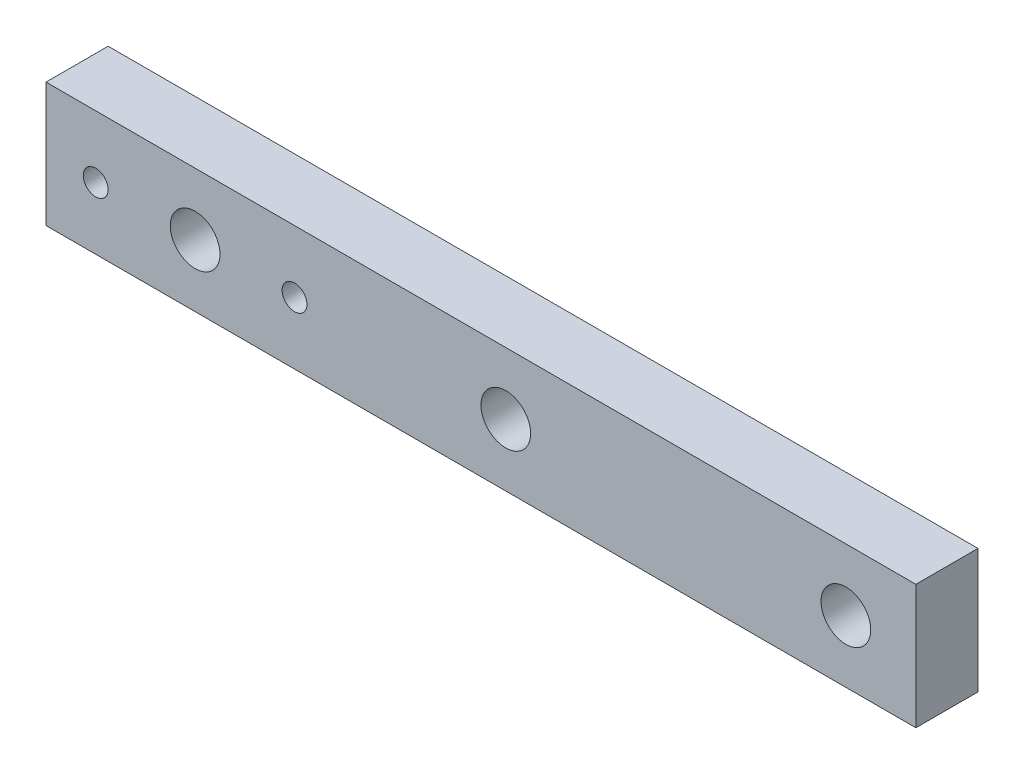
ISO-10303-21;
HEADER;
FILE_DESCRIPTION(('STEP AP214'),'2;1');
FILE_NAME('part.step','',(''),(''),'','','');
FILE_SCHEMA(('AUTOMOTIVE_DESIGN { 1 0 10303 214 1 1 1 1 }'));
ENDSEC;
DATA;
#1=APPLICATION_CONTEXT('core data for automotive mechanical design processes');
#2=APPLICATION_PROTOCOL_DEFINITION('international standard','automotive_design',2000,#1);
#3=PRODUCT_CONTEXT('',#1,'mechanical');
#4=PRODUCT('Part','Part','',(#3));
#5=PRODUCT_RELATED_PRODUCT_CATEGORY('part','',(#4));
#6=PRODUCT_DEFINITION_FORMATION('','',#4);
#7=PRODUCT_DEFINITION_CONTEXT('part definition',#1,'design');
#8=PRODUCT_DEFINITION('design','',#6,#7);
#9=PRODUCT_DEFINITION_SHAPE('','',#8);
#10=(LENGTH_UNIT() NAMED_UNIT(*) SI_UNIT(.MILLI.,.METRE.));
#11=(NAMED_UNIT(*) PLANE_ANGLE_UNIT() SI_UNIT($,.RADIAN.));
#12=(NAMED_UNIT(*) SI_UNIT($,.STERADIAN.) SOLID_ANGLE_UNIT());
#13=UNCERTAINTY_MEASURE_WITH_UNIT(LENGTH_MEASURE(1.E-05),#10,'distance_accuracy_value','');
#14=(GEOMETRIC_REPRESENTATION_CONTEXT(3) GLOBAL_UNCERTAINTY_ASSIGNED_CONTEXT((#13)) GLOBAL_UNIT_ASSIGNED_CONTEXT((#10,
#11,#12)) REPRESENTATION_CONTEXT('',''));
#15=CARTESIAN_POINT('',(0.,0.,0.));
#16=DIRECTION('',(0.,0.,1.));
#17=DIRECTION('',(1.,0.,0.));
#18=AXIS2_PLACEMENT_3D('',#15,#16,#17);
#19=CARTESIAN_POINT('',(-33.,5.,5.));
#20=DIRECTION('',(1.,0.,0.));
#21=DIRECTION('',(0.,0.,-1.));
#22=AXIS2_PLACEMENT_3D('',#19,#20,#21);
#23=PLANE('',#22);
#24=DIRECTION('',(0.,-1.,0.));
#25=VECTOR('',#24,1.);
#26=CARTESIAN_POINT('',(-33.,5.,0.));
#27=LINE('',#26,#25);
#28=CARTESIAN_POINT('',(-33.,5.,0.));
#29=VERTEX_POINT('',#28);
#30=CARTESIAN_POINT('',(-33.,-5.,0.));
#31=VERTEX_POINT('',#30);
#32=EDGE_CURVE('E98',#29,#31,#27,.T.);
#33=ORIENTED_EDGE('',*,*,#32,.T.);
#34=DIRECTION('',(0.,0.,-1.));
#35=VECTOR('',#34,1.);
#36=CARTESIAN_POINT('',(-33.,-5.,5.));
#37=LINE('',#36,#35);
#38=CARTESIAN_POINT('',(-33.,-5.,5.));
#39=VERTEX_POINT('',#38);
#40=EDGE_CURVE('E11',#39,#31,#37,.T.);
#41=ORIENTED_EDGE('',*,*,#40,.F.);
#42=DIRECTION('',(0.,-1.,0.));
#43=VECTOR('',#42,1.);
#44=CARTESIAN_POINT('',(-33.,5.,5.));
#45=LINE('',#44,#43);
#46=CARTESIAN_POINT('',(-33.,5.,5.));
#47=VERTEX_POINT('',#46);
#48=EDGE_CURVE('E86',#47,#39,#45,.T.);
#49=ORIENTED_EDGE('',*,*,#48,.F.);
#50=DIRECTION('',(0.,0.,-1.));
#51=VECTOR('',#50,1.);
#52=CARTESIAN_POINT('',(-33.,5.,5.));
#53=LINE('',#52,#51);
#54=EDGE_CURVE('E94',#47,#29,#53,.T.);
#55=ORIENTED_EDGE('',*,*,#54,.T.);
#56=EDGE_LOOP('',(#33,#41,#49,#55));
#57=FACE_BOUND('',#56,.T.);
#58=ADVANCED_FACE('F35',(#57),#23,.F.);
#59=CARTESIAN_POINT('',(-33.,-5.,5.));
#60=DIRECTION('',(0.,1.,0.));
#61=DIRECTION('',(0.,0.,1.));
#62=AXIS2_PLACEMENT_3D('',#59,#60,#61);
#63=PLANE('',#62);
#64=DIRECTION('',(1.,0.,0.));
#65=VECTOR('',#64,1.);
#66=CARTESIAN_POINT('',(-33.,-5.,0.));
#67=LINE('',#66,#65);
#68=CARTESIAN_POINT('',(37.,-5.,0.));
#69=VERTEX_POINT('',#68);
#70=EDGE_CURVE('E90',#31,#69,#67,.T.);
#71=ORIENTED_EDGE('',*,*,#70,.T.);
#72=DIRECTION('',(0.,0.,-1.));
#73=VECTOR('',#72,1.);
#74=CARTESIAN_POINT('',(37.,-5.,5.));
#75=LINE('',#74,#73);
#76=CARTESIAN_POINT('',(37.,-5.,5.));
#77=VERTEX_POINT('',#76);
#78=EDGE_CURVE('E43',#77,#69,#75,.T.);
#79=ORIENTED_EDGE('',*,*,#78,.F.);
#80=DIRECTION('',(1.,0.,0.));
#81=VECTOR('',#80,1.);
#82=CARTESIAN_POINT('',(-33.,-5.,5.));
#83=LINE('',#82,#81);
#84=EDGE_CURVE('E81',#39,#77,#83,.T.);
#85=ORIENTED_EDGE('',*,*,#84,.F.);
#86=ORIENTED_EDGE('',*,*,#40,.T.);
#87=EDGE_LOOP('',(#71,#79,#85,#86));
#88=FACE_BOUND('',#87,.T.);
#89=ADVANCED_FACE('F89',(#88),#63,.F.);
#90=CARTESIAN_POINT('',(37.,5.,5.));
#91=DIRECTION('',(-1.,0.,0.));
#92=DIRECTION('',(0.,-1.,0.));
#93=AXIS2_PLACEMENT_3D('',#90,#91,#92);
#94=PLANE('',#93);
#95=DIRECTION('',(0.,1.,0.));
#96=VECTOR('',#95,1.);
#97=CARTESIAN_POINT('',(37.,5.,0.));
#98=LINE('',#97,#96);
#99=CARTESIAN_POINT('',(37.,5.,0.));
#100=VERTEX_POINT('',#99);
#101=EDGE_CURVE('E68',#69,#100,#98,.T.);
#102=ORIENTED_EDGE('',*,*,#101,.T.);
#103=DIRECTION('',(0.,0.,-1.));
#104=VECTOR('',#103,1.);
#105=CARTESIAN_POINT('',(37.,5.,5.));
#106=LINE('',#105,#104);
#107=CARTESIAN_POINT('',(37.,5.,5.));
#108=VERTEX_POINT('',#107);
#109=EDGE_CURVE('E91',#108,#100,#106,.T.);
#110=ORIENTED_EDGE('',*,*,#109,.F.);
#111=DIRECTION('',(0.,1.,0.));
#112=VECTOR('',#111,1.);
#113=CARTESIAN_POINT('',(37.,5.,5.));
#114=LINE('',#113,#112);
#115=EDGE_CURVE('E84',#77,#108,#114,.T.);
#116=ORIENTED_EDGE('',*,*,#115,.F.);
#117=ORIENTED_EDGE('',*,*,#78,.T.);
#118=EDGE_LOOP('',(#102,#110,#116,#117));
#119=FACE_BOUND('',#118,.T.);
#120=ADVANCED_FACE('F92',(#119),#94,.F.);
#121=CARTESIAN_POINT('',(-33.,5.,5.));
#122=DIRECTION('',(0.,-1.,0.));
#123=DIRECTION('',(0.,0.,-1.));
#124=AXIS2_PLACEMENT_3D('',#121,#122,#123);
#125=PLANE('',#124);
#126=DIRECTION('',(-1.,0.,0.));
#127=VECTOR('',#126,1.);
#128=CARTESIAN_POINT('',(-33.,5.,0.));
#129=LINE('',#128,#127);
#130=EDGE_CURVE('E74',#100,#29,#129,.T.);
#131=ORIENTED_EDGE('',*,*,#130,.T.);
#132=ORIENTED_EDGE('',*,*,#54,.F.);
#133=DIRECTION('',(-1.,0.,0.));
#134=VECTOR('',#133,1.);
#135=CARTESIAN_POINT('',(-33.,5.,5.));
#136=LINE('',#135,#134);
#137=EDGE_CURVE('E51',#108,#47,#136,.T.);
#138=ORIENTED_EDGE('',*,*,#137,.F.);
#139=ORIENTED_EDGE('',*,*,#109,.T.);
#140=EDGE_LOOP('',(#131,#132,#138,#139));
#141=FACE_BOUND('',#140,.T.);
#142=ADVANCED_FACE('F106',(#141),#125,.F.);
#143=CARTESIAN_POINT('',(0.,0.,5.));
#144=DIRECTION('',(0.,0.,1.));
#145=DIRECTION('',(1.,0.,0.));
#146=AXIS2_PLACEMENT_3D('',#143,#144,#145);
#147=PLANE('',#146);
#148=CARTESIAN_POINT('',(31.367,0.,5.));
#149=DIRECTION('',(0.,0.,1.));
#150=DIRECTION('',(1.,0.,0.));
#151=AXIS2_PLACEMENT_3D('',#148,#149,#150);
#152=CIRCLE('',#151,2.00000000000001);
#153=CARTESIAN_POINT('',(33.367,0.,5.));
#154=VERTEX_POINT('',#153);
#155=EDGE_CURVE('E136',#154,#154,#152,.T.);
#156=ORIENTED_EDGE('',*,*,#155,.F.);
#157=EDGE_LOOP('',(#156));
#158=FACE_BOUND('',#157,.T.);
#159=CARTESIAN_POINT('',(4.,0.,5.));
#160=DIRECTION('',(0.,0.,1.));
#161=DIRECTION('',(1.,0.,0.));
#162=AXIS2_PLACEMENT_3D('',#159,#160,#161);
#163=CIRCLE('',#162,2.);
#164=CARTESIAN_POINT('',(6.,0.,5.));
#165=VERTEX_POINT('',#164);
#166=EDGE_CURVE('E130',#165,#165,#163,.T.);
#167=ORIENTED_EDGE('',*,*,#166,.F.);
#168=EDGE_LOOP('',(#167));
#169=FACE_BOUND('',#168,.T.);
#170=CARTESIAN_POINT('',(-13.,0.,5.));
#171=DIRECTION('',(0.,0.,1.));
#172=DIRECTION('',(1.,0.,0.));
#173=AXIS2_PLACEMENT_3D('',#170,#171,#172);
#174=CIRCLE('',#173,1.);
#175=CARTESIAN_POINT('',(-12.,0.,5.));
#176=VERTEX_POINT('',#175);
#177=EDGE_CURVE('E124',#176,#176,#174,.T.);
#178=ORIENTED_EDGE('',*,*,#177,.F.);
#179=EDGE_LOOP('',(#178));
#180=FACE_BOUND('',#179,.T.);
#181=CARTESIAN_POINT('',(-21.,0.,5.));
#182=DIRECTION('',(0.,0.,1.));
#183=DIRECTION('',(1.,0.,0.));
#184=AXIS2_PLACEMENT_3D('',#181,#182,#183);
#185=CIRCLE('',#184,2.);
#186=CARTESIAN_POINT('',(-19.,0.,5.));
#187=VERTEX_POINT('',#186);
#188=EDGE_CURVE('E118',#187,#187,#185,.T.);
#189=ORIENTED_EDGE('',*,*,#188,.F.);
#190=EDGE_LOOP('',(#189));
#191=FACE_BOUND('',#190,.T.);
#192=CARTESIAN_POINT('',(-29.,0.,5.));
#193=DIRECTION('',(0.,0.,1.));
#194=DIRECTION('',(1.,0.,0.));
#195=AXIS2_PLACEMENT_3D('',#192,#193,#194);
#196=CIRCLE('',#195,1.);
#197=CARTESIAN_POINT('',(-28.,0.,5.));
#198=VERTEX_POINT('',#197);
#199=EDGE_CURVE('E112',#198,#198,#196,.T.);
#200=ORIENTED_EDGE('',*,*,#199,.F.);
#201=EDGE_LOOP('',(#200));
#202=FACE_BOUND('',#201,.T.);
#203=ORIENTED_EDGE('',*,*,#48,.T.);
#204=ORIENTED_EDGE('',*,*,#84,.T.);
#205=ORIENTED_EDGE('',*,*,#115,.T.);
#206=ORIENTED_EDGE('',*,*,#137,.T.);
#207=EDGE_LOOP('',(#203,#204,#205,#206));
#208=FACE_BOUND('',#207,.T.);
#209=ADVANCED_FACE('F82',(#158,#169,#180,#191,#202,#208),#147,.T.);
#210=CARTESIAN_POINT('',(0.,0.,0.));
#211=DIRECTION('',(0.,0.,1.));
#212=DIRECTION('',(1.,0.,0.));
#213=AXIS2_PLACEMENT_3D('',#210,#211,#212);
#214=PLANE('',#213);
#215=CARTESIAN_POINT('',(31.367,0.,0.));
#216=DIRECTION('',(0.,0.,1.));
#217=DIRECTION('',(1.,0.,0.));
#218=AXIS2_PLACEMENT_3D('',#215,#216,#217);
#219=CIRCLE('',#218,2.00000000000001);
#220=CARTESIAN_POINT('',(33.367,0.,0.));
#221=VERTEX_POINT('',#220);
#222=EDGE_CURVE('E133',#221,#221,#219,.T.);
#223=ORIENTED_EDGE('',*,*,#222,.T.);
#224=EDGE_LOOP('',(#223));
#225=FACE_BOUND('',#224,.T.);
#226=CARTESIAN_POINT('',(4.,0.,0.));
#227=DIRECTION('',(0.,0.,1.));
#228=DIRECTION('',(1.,0.,0.));
#229=AXIS2_PLACEMENT_3D('',#226,#227,#228);
#230=CIRCLE('',#229,2.);
#231=CARTESIAN_POINT('',(6.,0.,0.));
#232=VERTEX_POINT('',#231);
#233=EDGE_CURVE('E127',#232,#232,#230,.T.);
#234=ORIENTED_EDGE('',*,*,#233,.T.);
#235=EDGE_LOOP('',(#234));
#236=FACE_BOUND('',#235,.T.);
#237=CARTESIAN_POINT('',(-13.,0.,0.));
#238=DIRECTION('',(0.,0.,1.));
#239=DIRECTION('',(1.,0.,0.));
#240=AXIS2_PLACEMENT_3D('',#237,#238,#239);
#241=CIRCLE('',#240,1.);
#242=CARTESIAN_POINT('',(-12.,0.,0.));
#243=VERTEX_POINT('',#242);
#244=EDGE_CURVE('E121',#243,#243,#241,.T.);
#245=ORIENTED_EDGE('',*,*,#244,.T.);
#246=EDGE_LOOP('',(#245));
#247=FACE_BOUND('',#246,.T.);
#248=CARTESIAN_POINT('',(-21.,0.,0.));
#249=DIRECTION('',(0.,0.,1.));
#250=DIRECTION('',(1.,0.,0.));
#251=AXIS2_PLACEMENT_3D('',#248,#249,#250);
#252=CIRCLE('',#251,2.);
#253=CARTESIAN_POINT('',(-19.,0.,0.));
#254=VERTEX_POINT('',#253);
#255=EDGE_CURVE('E115',#254,#254,#252,.T.);
#256=ORIENTED_EDGE('',*,*,#255,.T.);
#257=EDGE_LOOP('',(#256));
#258=FACE_BOUND('',#257,.T.);
#259=CARTESIAN_POINT('',(-29.,0.,0.));
#260=DIRECTION('',(0.,0.,1.));
#261=DIRECTION('',(1.,0.,0.));
#262=AXIS2_PLACEMENT_3D('',#259,#260,#261);
#263=CIRCLE('',#262,1.);
#264=CARTESIAN_POINT('',(-28.,0.,0.));
#265=VERTEX_POINT('',#264);
#266=EDGE_CURVE('E101',#265,#265,#263,.T.);
#267=ORIENTED_EDGE('',*,*,#266,.T.);
#268=EDGE_LOOP('',(#267));
#269=FACE_BOUND('',#268,.T.);
#270=ORIENTED_EDGE('',*,*,#32,.F.);
#271=ORIENTED_EDGE('',*,*,#130,.F.);
#272=ORIENTED_EDGE('',*,*,#101,.F.);
#273=ORIENTED_EDGE('',*,*,#70,.F.);
#274=EDGE_LOOP('',(#270,#271,#272,#273));
#275=FACE_BOUND('',#274,.T.);
#276=ADVANCED_FACE('F109',(#225,#236,#247,#258,#269,#275),#214,.F.);
#277=CARTESIAN_POINT('',(-29.,0.,0.));
#278=DIRECTION('',(0.,0.,1.));
#279=DIRECTION('',(1.,0.,0.));
#280=AXIS2_PLACEMENT_3D('',#277,#278,#279);
#281=CYLINDRICAL_SURFACE('',#280,1.);
#282=ORIENTED_EDGE('',*,*,#266,.F.);
#283=EDGE_LOOP('',(#282));
#284=FACE_BOUND('',#283,.T.);
#285=ORIENTED_EDGE('',*,*,#199,.T.);
#286=EDGE_LOOP('',(#285));
#287=FACE_BOUND('',#286,.T.);
#288=ADVANCED_FACE('F162',(#284,#287),#281,.F.);
#289=CARTESIAN_POINT('',(-21.,0.,0.));
#290=DIRECTION('',(0.,0.,1.));
#291=DIRECTION('',(1.,0.,0.));
#292=AXIS2_PLACEMENT_3D('',#289,#290,#291);
#293=CYLINDRICAL_SURFACE('',#292,2.);
#294=ORIENTED_EDGE('',*,*,#255,.F.);
#295=EDGE_LOOP('',(#294));
#296=FACE_BOUND('',#295,.T.);
#297=ORIENTED_EDGE('',*,*,#188,.T.);
#298=EDGE_LOOP('',(#297));
#299=FACE_BOUND('',#298,.T.);
#300=ADVANCED_FACE('F164',(#296,#299),#293,.F.);
#301=CARTESIAN_POINT('',(-13.,0.,0.));
#302=DIRECTION('',(0.,0.,1.));
#303=DIRECTION('',(1.,0.,0.));
#304=AXIS2_PLACEMENT_3D('',#301,#302,#303);
#305=CYLINDRICAL_SURFACE('',#304,1.);
#306=ORIENTED_EDGE('',*,*,#244,.F.);
#307=EDGE_LOOP('',(#306));
#308=FACE_BOUND('',#307,.T.);
#309=ORIENTED_EDGE('',*,*,#177,.T.);
#310=EDGE_LOOP('',(#309));
#311=FACE_BOUND('',#310,.T.);
#312=ADVANCED_FACE('F171',(#308,#311),#305,.F.);
#313=CARTESIAN_POINT('',(4.,0.,0.));
#314=DIRECTION('',(0.,0.,1.));
#315=DIRECTION('',(1.,0.,0.));
#316=AXIS2_PLACEMENT_3D('',#313,#314,#315);
#317=CYLINDRICAL_SURFACE('',#316,2.);
#318=ORIENTED_EDGE('',*,*,#233,.F.);
#319=EDGE_LOOP('',(#318));
#320=FACE_BOUND('',#319,.T.);
#321=ORIENTED_EDGE('',*,*,#166,.T.);
#322=EDGE_LOOP('',(#321));
#323=FACE_BOUND('',#322,.T.);
#324=ADVANCED_FACE('F147',(#320,#323),#317,.F.);
#325=CARTESIAN_POINT('',(31.367,0.,0.));
#326=DIRECTION('',(0.,0.,1.));
#327=DIRECTION('',(1.,0.,0.));
#328=AXIS2_PLACEMENT_3D('',#325,#326,#327);
#329=CYLINDRICAL_SURFACE('',#328,2.00000000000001);
#330=ORIENTED_EDGE('',*,*,#222,.F.);
#331=EDGE_LOOP('',(#330));
#332=FACE_BOUND('',#331,.T.);
#333=ORIENTED_EDGE('',*,*,#155,.T.);
#334=EDGE_LOOP('',(#333));
#335=FACE_BOUND('',#334,.T.);
#336=ADVANCED_FACE('F144',(#332,#335),#329,.F.);
#337=CLOSED_SHELL('',(#58,#89,#120,#142,#209,#276,#288,#300,#312,#324,#336));
#338=MANIFOLD_SOLID_BREP('B2',#337);
#339=ADVANCED_BREP_SHAPE_REPRESENTATION('',(#18,#338),#14);
#340=SHAPE_DEFINITION_REPRESENTATION(#9,#339);
ENDSEC;
END-ISO-10303-21;
